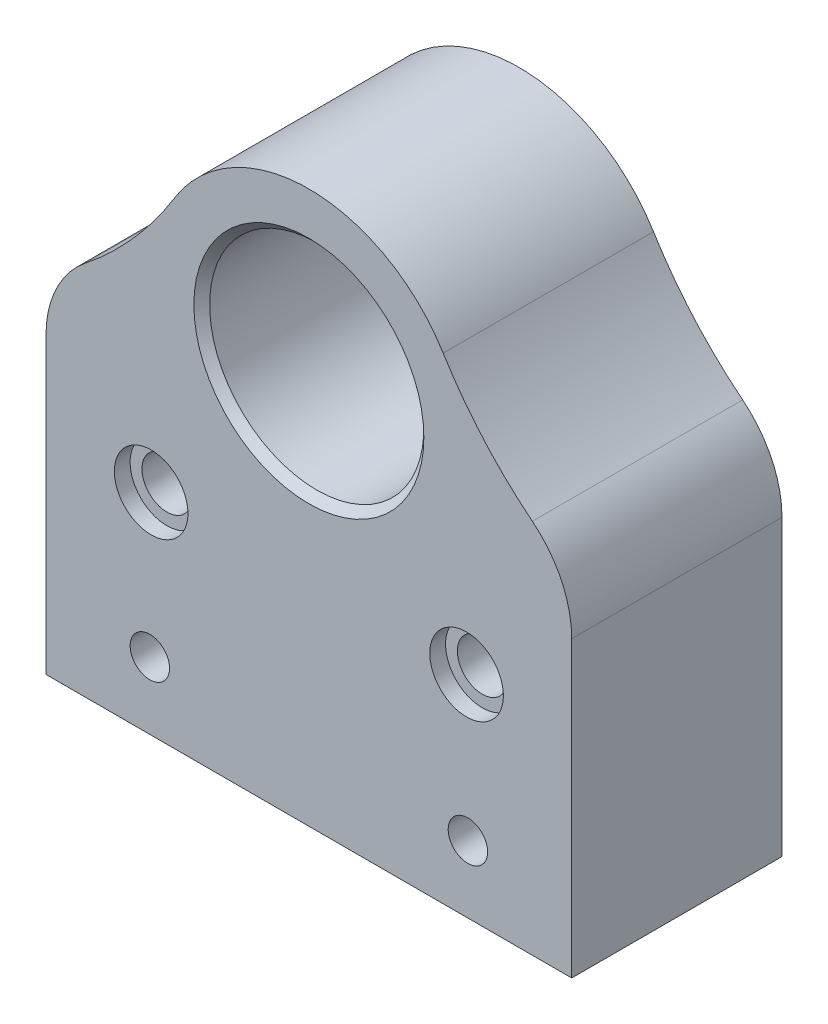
ISO-10303-21;
HEADER;
FILE_DESCRIPTION(('STEP AP214'),'2;1');
FILE_NAME('part.step','',(''),(''),'','','');
FILE_SCHEMA(('AUTOMOTIVE_DESIGN { 1 0 10303 214 1 1 1 1 }'));
ENDSEC;
DATA;
#1=APPLICATION_CONTEXT('core data for automotive mechanical design processes');
#2=APPLICATION_PROTOCOL_DEFINITION('international standard','automotive_design',2000,#1);
#3=PRODUCT_CONTEXT('',#1,'mechanical');
#4=PRODUCT('Part','Part','',(#3));
#5=PRODUCT_RELATED_PRODUCT_CATEGORY('part','',(#4));
#6=PRODUCT_DEFINITION_FORMATION('','',#4);
#7=PRODUCT_DEFINITION_CONTEXT('part definition',#1,'design');
#8=PRODUCT_DEFINITION('design','',#6,#7);
#9=PRODUCT_DEFINITION_SHAPE('','',#8);
#10=(LENGTH_UNIT() NAMED_UNIT(*) SI_UNIT(.MILLI.,.METRE.));
#11=(NAMED_UNIT(*) PLANE_ANGLE_UNIT() SI_UNIT($,.RADIAN.));
#12=(NAMED_UNIT(*) SI_UNIT($,.STERADIAN.) SOLID_ANGLE_UNIT());
#13=UNCERTAINTY_MEASURE_WITH_UNIT(LENGTH_MEASURE(1.E-05),#10,'distance_accuracy_value','');
#14=(GEOMETRIC_REPRESENTATION_CONTEXT(3) GLOBAL_UNCERTAINTY_ASSIGNED_CONTEXT((#13)) GLOBAL_UNIT_ASSIGNED_CONTEXT((#10,
#11,#12)) REPRESENTATION_CONTEXT('',''));
#15=CARTESIAN_POINT('',(0.,0.,0.));
#16=DIRECTION('',(0.,0.,1.));
#17=DIRECTION('',(1.,0.,0.));
#18=AXIS2_PLACEMENT_3D('',#15,#16,#17);
#19=CARTESIAN_POINT('',(0.,0.,4.8));
#20=DIRECTION('',(0.,0.,-1.));
#21=DIRECTION('',(0.,1.,0.));
#22=AXIS2_PLACEMENT_3D('',#19,#20,#21);
#23=CONICAL_SURFACE('',#22,4.075,0.785398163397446);
#24=CARTESIAN_POINT('',(0.,0.,4.8));
#25=DIRECTION('',(0.,0.,-1.));
#26=DIRECTION('',(0.,1.,0.));
#27=AXIS2_PLACEMENT_3D('',#24,#25,#26);
#28=CIRCLE('',#27,4.075);
#29=CARTESIAN_POINT('',(0.,4.075,4.8));
#30=VERTEX_POINT('',#29);
#31=EDGE_CURVE('E226',#30,#30,#28,.T.);
#32=ORIENTED_EDGE('',*,*,#31,.F.);
#33=EDGE_LOOP('',(#32));
#34=FACE_BOUND('',#33,.T.);
#35=CARTESIAN_POINT('',(0.,0.,4.5));
#36=DIRECTION('',(0.,0.,1.));
#37=DIRECTION('',(0.,1.,0.));
#38=AXIS2_PLACEMENT_3D('',#35,#36,#37);
#39=CIRCLE('',#38,4.375);
#40=CARTESIAN_POINT('',(0.,4.375,4.5));
#41=VERTEX_POINT('',#40);
#42=EDGE_CURVE('E184',#41,#41,#39,.T.);
#43=ORIENTED_EDGE('',*,*,#42,.F.);
#44=EDGE_LOOP('',(#43));
#45=FACE_BOUND('',#44,.T.);
#46=ADVANCED_FACE('F16',(#34,#45),#23,.F.);
#47=CARTESIAN_POINT('',(0.,0.,12.2));
#48=DIRECTION('',(0.,0.,1.));
#49=DIRECTION('',(0.,-1.,0.));
#50=AXIS2_PLACEMENT_3D('',#47,#48,#49);
#51=CONICAL_SURFACE('',#50,4.075,0.785398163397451);
#52=CARTESIAN_POINT('',(0.,0.,12.2));
#53=DIRECTION('',(0.,0.,1.));
#54=DIRECTION('',(0.,-1.,0.));
#55=AXIS2_PLACEMENT_3D('',#52,#53,#54);
#56=CIRCLE('',#55,4.075);
#57=CARTESIAN_POINT('',(0.,-4.075,12.2));
#58=VERTEX_POINT('',#57);
#59=EDGE_CURVE('E245',#58,#58,#56,.T.);
#60=ORIENTED_EDGE('',*,*,#59,.F.);
#61=EDGE_LOOP('',(#60));
#62=FACE_BOUND('',#61,.T.);
#63=CARTESIAN_POINT('',(0.,0.,12.5));
#64=DIRECTION('',(0.,0.,-1.));
#65=DIRECTION('',(0.,-1.,0.));
#66=AXIS2_PLACEMENT_3D('',#63,#64,#65);
#67=CIRCLE('',#66,4.375);
#68=CARTESIAN_POINT('',(0.,-4.375,12.5));
#69=VERTEX_POINT('',#68);
#70=EDGE_CURVE('E250',#69,#69,#67,.T.);
#71=ORIENTED_EDGE('',*,*,#70,.F.);
#72=EDGE_LOOP('',(#71));
#73=FACE_BOUND('',#72,.T.);
#74=ADVANCED_FACE('F373',(#62,#73),#51,.F.);
#75=CARTESIAN_POINT('',(-6.,-3.82101635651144,8.5));
#76=DIRECTION('',(0.,0.,1.));
#77=DIRECTION('',(0.,-1.,0.));
#78=AXIS2_PLACEMENT_3D('',#75,#76,#77);
#79=CYLINDRICAL_SURFACE('',#78,4.);
#80=CARTESIAN_POINT('',(-6.,-3.82101635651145,12.5));
#81=DIRECTION('',(0.,0.,1.));
#82=DIRECTION('',(0.,-1.,0.));
#83=AXIS2_PLACEMENT_3D('',#80,#81,#82);
#84=CIRCLE('',#83,4.);
#85=CARTESIAN_POINT('',(-8.50285133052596,-0.700802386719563,12.5));
#86=VERTEX_POINT('',#85);
#87=CARTESIAN_POINT('',(-10.,-3.82101635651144,12.5));
#88=VERTEX_POINT('',#87);
#89=EDGE_CURVE('E285',#86,#88,#84,.T.);
#90=ORIENTED_EDGE('',*,*,#89,.F.);
#91=DIRECTION('',(0.,0.,1.));
#92=VECTOR('',#91,1.);
#93=CARTESIAN_POINT('',(-8.50285133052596,-0.700802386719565,8.5));
#94=LINE('',#93,#92);
#95=CARTESIAN_POINT('',(-8.50285133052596,-0.700802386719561,4.5));
#96=VERTEX_POINT('',#95);
#97=EDGE_CURVE('E11',#96,#86,#94,.T.);
#98=ORIENTED_EDGE('',*,*,#97,.F.);
#99=CARTESIAN_POINT('',(-6.,-3.82101635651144,4.5));
#100=DIRECTION('',(0.,0.,-1.));
#101=DIRECTION('',(0.,1.,0.));
#102=AXIS2_PLACEMENT_3D('',#99,#100,#101);
#103=CIRCLE('',#102,4.);
#104=CARTESIAN_POINT('',(-10.,-3.82101635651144,4.5));
#105=VERTEX_POINT('',#104);
#106=EDGE_CURVE('E201',#105,#96,#103,.T.);
#107=ORIENTED_EDGE('',*,*,#106,.F.);
#108=DIRECTION('',(0.,0.,-1.));
#109=VECTOR('',#108,1.);
#110=CARTESIAN_POINT('',(-10.,-3.82101635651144,8.5));
#111=LINE('',#110,#109);
#112=EDGE_CURVE('E246',#88,#105,#111,.T.);
#113=ORIENTED_EDGE('',*,*,#112,.F.);
#114=EDGE_LOOP('',(#90,#98,#107,#113));
#115=FACE_BOUND('',#114,.T.);
#116=ADVANCED_FACE('F359',(#115),#79,.T.);
#117=CARTESIAN_POINT('',(6.,-3.82101635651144,8.5));
#118=DIRECTION('',(0.,0.,1.));
#119=DIRECTION('',(0.,-1.,0.));
#120=AXIS2_PLACEMENT_3D('',#117,#118,#119);
#121=CYLINDRICAL_SURFACE('',#120,4.);
#122=CARTESIAN_POINT('',(6.,-3.82101635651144,4.5));
#123=DIRECTION('',(0.,0.,-1.));
#124=DIRECTION('',(0.,1.,0.));
#125=AXIS2_PLACEMENT_3D('',#122,#123,#124);
#126=CIRCLE('',#125,4.);
#127=CARTESIAN_POINT('',(8.50285133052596,-0.700802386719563,4.5));
#128=VERTEX_POINT('',#127);
#129=CARTESIAN_POINT('',(10.,-3.82101635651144,4.5));
#130=VERTEX_POINT('',#129);
#131=EDGE_CURVE('E218',#128,#130,#126,.T.);
#132=ORIENTED_EDGE('',*,*,#131,.F.);
#133=DIRECTION('',(0.,0.,-1.));
#134=VECTOR('',#133,1.);
#135=CARTESIAN_POINT('',(8.50285133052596,-0.700802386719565,8.5));
#136=LINE('',#135,#134);
#137=CARTESIAN_POINT('',(8.50285133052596,-0.700802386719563,12.5));
#138=VERTEX_POINT('',#137);
#139=EDGE_CURVE('E24',#138,#128,#136,.T.);
#140=ORIENTED_EDGE('',*,*,#139,.F.);
#141=CARTESIAN_POINT('',(6.,-3.82101635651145,12.5));
#142=DIRECTION('',(0.,0.,1.));
#143=DIRECTION('',(0.,-1.,0.));
#144=AXIS2_PLACEMENT_3D('',#141,#142,#143);
#145=CIRCLE('',#144,4.);
#146=CARTESIAN_POINT('',(10.,-3.82101635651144,12.5));
#147=VERTEX_POINT('',#146);
#148=EDGE_CURVE('E269',#147,#138,#145,.T.);
#149=ORIENTED_EDGE('',*,*,#148,.F.);
#150=DIRECTION('',(0.,0.,1.));
#151=VECTOR('',#150,1.);
#152=CARTESIAN_POINT('',(10.,-3.82101635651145,12.5));
#153=LINE('',#152,#151);
#154=EDGE_CURVE('E242',#130,#147,#153,.T.);
#155=ORIENTED_EDGE('',*,*,#154,.F.);
#156=EDGE_LOOP('',(#132,#140,#149,#155));
#157=FACE_BOUND('',#156,.T.);
#158=ADVANCED_FACE('F331',(#157),#121,.T.);
#159=CARTESIAN_POINT('',(-17.8885438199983,11.,8.5));
#160=DIRECTION('',(0.,0.,1.));
#161=DIRECTION('',(0.,-1.,0.));
#162=AXIS2_PLACEMENT_3D('',#159,#160,#161);
#163=CYLINDRICAL_SURFACE('',#162,15.);
#164=CARTESIAN_POINT('',(-17.8885438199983,11.,4.5));
#165=DIRECTION('',(0.,0.,1.));
#166=DIRECTION('',(0.,1.,0.));
#167=AXIS2_PLACEMENT_3D('',#164,#165,#166);
#168=CIRCLE('',#167,15.);
#169=CARTESIAN_POINT('',(-5.11101251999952,3.14285714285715,4.5));
#170=VERTEX_POINT('',#169);
#171=EDGE_CURVE('E205',#96,#170,#168,.T.);
#172=ORIENTED_EDGE('',*,*,#171,.F.);
#173=ORIENTED_EDGE('',*,*,#97,.T.);
#174=CARTESIAN_POINT('',(-17.8885438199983,11.,12.5));
#175=DIRECTION('',(0.,0.,-1.));
#176=DIRECTION('',(0.,-1.,0.));
#177=AXIS2_PLACEMENT_3D('',#174,#175,#176);
#178=CIRCLE('',#177,15.);
#179=CARTESIAN_POINT('',(-5.11101251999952,3.14285714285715,12.5));
#180=VERTEX_POINT('',#179);
#181=EDGE_CURVE('E281',#180,#86,#178,.T.);
#182=ORIENTED_EDGE('',*,*,#181,.F.);
#183=DIRECTION('',(0.,0.,1.));
#184=VECTOR('',#183,1.);
#185=CARTESIAN_POINT('',(-5.11101251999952,3.14285714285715,8.5));
#186=LINE('',#185,#184);
#187=EDGE_CURVE('E225',#170,#180,#186,.T.);
#188=ORIENTED_EDGE('',*,*,#187,.F.);
#189=EDGE_LOOP('',(#172,#173,#182,#188));
#190=FACE_BOUND('',#189,.T.);
#191=ADVANCED_FACE('F361',(#190),#163,.F.);
#192=CARTESIAN_POINT('',(17.8885438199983,11.,8.5));
#193=DIRECTION('',(0.,0.,1.));
#194=DIRECTION('',(0.,-1.,0.));
#195=AXIS2_PLACEMENT_3D('',#192,#193,#194);
#196=CYLINDRICAL_SURFACE('',#195,15.);
#197=CARTESIAN_POINT('',(17.8885438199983,11.,12.5));
#198=DIRECTION('',(0.,0.,-1.));
#199=DIRECTION('',(0.,-1.,0.));
#200=AXIS2_PLACEMENT_3D('',#197,#198,#199);
#201=CIRCLE('',#200,15.);
#202=CARTESIAN_POINT('',(5.11101251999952,3.14285714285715,12.5));
#203=VERTEX_POINT('',#202);
#204=EDGE_CURVE('E273',#138,#203,#201,.T.);
#205=ORIENTED_EDGE('',*,*,#204,.F.);
#206=ORIENTED_EDGE('',*,*,#139,.T.);
#207=CARTESIAN_POINT('',(17.8885438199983,11.,4.5));
#208=DIRECTION('',(0.,0.,1.));
#209=DIRECTION('',(0.,1.,0.));
#210=AXIS2_PLACEMENT_3D('',#207,#208,#209);
#211=CIRCLE('',#210,15.);
#212=CARTESIAN_POINT('',(5.11101251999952,3.14285714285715,4.5));
#213=VERTEX_POINT('',#212);
#214=EDGE_CURVE('E209',#213,#128,#211,.T.);
#215=ORIENTED_EDGE('',*,*,#214,.F.);
#216=DIRECTION('',(0.,0.,-1.));
#217=VECTOR('',#216,1.);
#218=CARTESIAN_POINT('',(5.11101251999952,3.14285714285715,8.5));
#219=LINE('',#218,#217);
#220=EDGE_CURVE('E222',#203,#213,#219,.T.);
#221=ORIENTED_EDGE('',*,*,#220,.F.);
#222=EDGE_LOOP('',(#205,#206,#215,#221));
#223=FACE_BOUND('',#222,.T.);
#224=ADVANCED_FACE('F328',(#223),#196,.F.);
#225=CARTESIAN_POINT('',(6.,-7.,12.5));
#226=DIRECTION('',(0.,0.,-1.));
#227=DIRECTION('',(0.,1.,0.));
#228=AXIS2_PLACEMENT_3D('',#225,#226,#227);
#229=CYLINDRICAL_SURFACE('',#228,1.4);
#230=CARTESIAN_POINT('',(6.,-7.,12.5));
#231=DIRECTION('',(0.,0.,-1.));
#232=DIRECTION('',(0.,1.,0.));
#233=AXIS2_PLACEMENT_3D('',#230,#231,#232);
#234=CIRCLE('',#233,1.4);
#235=CARTESIAN_POINT('',(6.,-5.6,12.5));
#236=VERTEX_POINT('',#235);
#237=EDGE_CURVE('E253',#236,#236,#234,.T.);
#238=ORIENTED_EDGE('',*,*,#237,.F.);
#239=EDGE_LOOP('',(#238));
#240=FACE_BOUND('',#239,.T.);
#241=CARTESIAN_POINT('',(6.,-7.,11.9));
#242=DIRECTION('',(0.,0.,-1.));
#243=DIRECTION('',(0.,1.,0.));
#244=AXIS2_PLACEMENT_3D('',#241,#242,#243);
#245=CIRCLE('',#244,1.4);
#246=CARTESIAN_POINT('',(6.,-5.6,11.9));
#247=VERTEX_POINT('',#246);
#248=EDGE_CURVE('E34',#247,#247,#245,.T.);
#249=ORIENTED_EDGE('',*,*,#248,.T.);
#250=EDGE_LOOP('',(#249));
#251=FACE_BOUND('',#250,.T.);
#252=ADVANCED_FACE('F369',(#240,#251),#229,.F.);
#253=CARTESIAN_POINT('',(7.4,-7.,11.9));
#254=DIRECTION('',(0.,0.,1.));
#255=DIRECTION('',(0.,-1.,0.));
#256=AXIS2_PLACEMENT_3D('',#253,#254,#255);
#257=PLANE('',#256);
#258=ORIENTED_EDGE('',*,*,#248,.F.);
#259=EDGE_LOOP('',(#258));
#260=FACE_BOUND('',#259,.T.);
#261=CARTESIAN_POINT('',(6.,-7.,11.9));
#262=DIRECTION('',(0.,0.,-1.));
#263=DIRECTION('',(0.,1.,0.));
#264=AXIS2_PLACEMENT_3D('',#261,#262,#263);
#265=CIRCLE('',#264,0.95);
#266=CARTESIAN_POINT('',(6.,-6.05,11.9));
#267=VERTEX_POINT('',#266);
#268=EDGE_CURVE('E41',#267,#267,#265,.T.);
#269=ORIENTED_EDGE('',*,*,#268,.T.);
#270=EDGE_LOOP('',(#269));
#271=FACE_BOUND('',#270,.T.);
#272=ADVANCED_FACE('F411',(#260,#271),#257,.T.);
#273=CARTESIAN_POINT('',(6.,-7.,12.5));
#274=DIRECTION('',(0.,0.,-1.));
#275=DIRECTION('',(0.,1.,0.));
#276=AXIS2_PLACEMENT_3D('',#273,#274,#275);
#277=CYLINDRICAL_SURFACE('',#276,0.95);
#278=ORIENTED_EDGE('',*,*,#268,.F.);
#279=EDGE_LOOP('',(#278));
#280=FACE_BOUND('',#279,.T.);
#281=CARTESIAN_POINT('',(6.,-7.,4.5));
#282=DIRECTION('',(0.,0.,-1.));
#283=DIRECTION('',(0.,1.,0.));
#284=AXIS2_PLACEMENT_3D('',#281,#282,#283);
#285=CIRCLE('',#284,0.95);
#286=CARTESIAN_POINT('',(6.,-6.05,4.5));
#287=VERTEX_POINT('',#286);
#288=EDGE_CURVE('E179',#287,#287,#285,.T.);
#289=ORIENTED_EDGE('',*,*,#288,.T.);
#290=EDGE_LOOP('',(#289));
#291=FACE_BOUND('',#290,.T.);
#292=ADVANCED_FACE('F180',(#280,#291),#277,.F.);
#293=CARTESIAN_POINT('',(-6.,-7.,12.5));
#294=DIRECTION('',(0.,0.,-1.));
#295=DIRECTION('',(0.,1.,0.));
#296=AXIS2_PLACEMENT_3D('',#293,#294,#295);
#297=CYLINDRICAL_SURFACE('',#296,1.4);
#298=CARTESIAN_POINT('',(-6.,-7.,12.5));
#299=DIRECTION('',(0.,0.,-1.));
#300=DIRECTION('',(0.,1.,0.));
#301=AXIS2_PLACEMENT_3D('',#298,#299,#300);
#302=CIRCLE('',#301,1.4);
#303=CARTESIAN_POINT('',(-6.,-5.6,12.5));
#304=VERTEX_POINT('',#303);
#305=EDGE_CURVE('E237',#304,#304,#302,.T.);
#306=ORIENTED_EDGE('',*,*,#305,.F.);
#307=EDGE_LOOP('',(#306));
#308=FACE_BOUND('',#307,.T.);
#309=CARTESIAN_POINT('',(-6.,-7.,11.9));
#310=DIRECTION('',(0.,0.,-1.));
#311=DIRECTION('',(0.,1.,0.));
#312=AXIS2_PLACEMENT_3D('',#309,#310,#311);
#313=CIRCLE('',#312,1.4);
#314=CARTESIAN_POINT('',(-6.,-5.6,11.9));
#315=VERTEX_POINT('',#314);
#316=EDGE_CURVE('E318',#315,#315,#313,.T.);
#317=ORIENTED_EDGE('',*,*,#316,.T.);
#318=EDGE_LOOP('',(#317));
#319=FACE_BOUND('',#318,.T.);
#320=ADVANCED_FACE('F410',(#308,#319),#297,.F.);
#321=CARTESIAN_POINT('',(-4.6,-7.,11.9));
#322=DIRECTION('',(0.,0.,1.));
#323=DIRECTION('',(0.,-1.,0.));
#324=AXIS2_PLACEMENT_3D('',#321,#322,#323);
#325=PLANE('',#324);
#326=ORIENTED_EDGE('',*,*,#316,.F.);
#327=EDGE_LOOP('',(#326));
#328=FACE_BOUND('',#327,.T.);
#329=CARTESIAN_POINT('',(-6.,-7.,11.9));
#330=DIRECTION('',(0.,0.,-1.));
#331=DIRECTION('',(0.,1.,0.));
#332=AXIS2_PLACEMENT_3D('',#329,#330,#331);
#333=CIRCLE('',#332,0.95);
#334=CARTESIAN_POINT('',(-6.,-6.05,11.9));
#335=VERTEX_POINT('',#334);
#336=EDGE_CURVE('E315',#335,#335,#333,.T.);
#337=ORIENTED_EDGE('',*,*,#336,.T.);
#338=EDGE_LOOP('',(#337));
#339=FACE_BOUND('',#338,.T.);
#340=ADVANCED_FACE('F428',(#328,#339),#325,.T.);
#341=CARTESIAN_POINT('',(-6.,-7.,12.5));
#342=DIRECTION('',(0.,0.,-1.));
#343=DIRECTION('',(0.,1.,0.));
#344=AXIS2_PLACEMENT_3D('',#341,#342,#343);
#345=CYLINDRICAL_SURFACE('',#344,0.95);
#346=ORIENTED_EDGE('',*,*,#336,.F.);
#347=EDGE_LOOP('',(#346));
#348=FACE_BOUND('',#347,.T.);
#349=CARTESIAN_POINT('',(-6.,-7.,4.5));
#350=DIRECTION('',(0.,0.,-1.));
#351=DIRECTION('',(0.,1.,0.));
#352=AXIS2_PLACEMENT_3D('',#349,#350,#351);
#353=CIRCLE('',#352,0.95);
#354=CARTESIAN_POINT('',(-6.,-6.05,4.5));
#355=VERTEX_POINT('',#354);
#356=EDGE_CURVE('E183',#355,#355,#353,.T.);
#357=ORIENTED_EDGE('',*,*,#356,.T.);
#358=EDGE_LOOP('',(#357));
#359=FACE_BOUND('',#358,.T.);
#360=ADVANCED_FACE('F431',(#348,#359),#345,.F.);
#361=CARTESIAN_POINT('',(-6.05,-12.45,4.5));
#362=DIRECTION('',(0.,0.,1.));
#363=DIRECTION('',(0.,-1.,0.));
#364=AXIS2_PLACEMENT_3D('',#361,#362,#363);
#365=CYLINDRICAL_SURFACE('',#364,1.1);
#366=CARTESIAN_POINT('',(-6.05,-12.45,4.5));
#367=DIRECTION('',(0.,0.,1.));
#368=DIRECTION('',(0.,-1.,0.));
#369=AXIS2_PLACEMENT_3D('',#366,#367,#368);
#370=CIRCLE('',#369,1.1);
#371=CARTESIAN_POINT('',(-6.05,-13.55,4.5));
#372=VERTEX_POINT('',#371);
#373=EDGE_CURVE('E189',#372,#372,#370,.T.);
#374=ORIENTED_EDGE('',*,*,#373,.F.);
#375=EDGE_LOOP('',(#374));
#376=FACE_BOUND('',#375,.T.);
#377=CARTESIAN_POINT('',(-6.05,-12.45,5.1));
#378=DIRECTION('',(0.,0.,1.));
#379=DIRECTION('',(0.,-1.,0.));
#380=AXIS2_PLACEMENT_3D('',#377,#378,#379);
#381=CIRCLE('',#380,1.1);
#382=CARTESIAN_POINT('',(-6.05,-13.55,5.1));
#383=VERTEX_POINT('',#382);
#384=EDGE_CURVE('E312',#383,#383,#381,.T.);
#385=ORIENTED_EDGE('',*,*,#384,.T.);
#386=EDGE_LOOP('',(#385));
#387=FACE_BOUND('',#386,.T.);
#388=ADVANCED_FACE('F426',(#376,#387),#365,.F.);
#389=CARTESIAN_POINT('',(-4.95,-12.45,5.1));
#390=DIRECTION('',(0.,0.,-1.));
#391=DIRECTION('',(-1.,0.,0.));
#392=AXIS2_PLACEMENT_3D('',#389,#390,#391);
#393=PLANE('',#392);
#394=ORIENTED_EDGE('',*,*,#384,.F.);
#395=EDGE_LOOP('',(#394));
#396=FACE_BOUND('',#395,.T.);
#397=CARTESIAN_POINT('',(-6.05,-12.45,5.1));
#398=DIRECTION('',(0.,0.,1.));
#399=DIRECTION('',(0.,-1.,0.));
#400=AXIS2_PLACEMENT_3D('',#397,#398,#399);
#401=CIRCLE('',#400,0.75);
#402=CARTESIAN_POINT('',(-6.05,-13.2,5.1));
#403=VERTEX_POINT('',#402);
#404=EDGE_CURVE('E307',#403,#403,#401,.T.);
#405=ORIENTED_EDGE('',*,*,#404,.T.);
#406=EDGE_LOOP('',(#405));
#407=FACE_BOUND('',#406,.T.);
#408=ADVANCED_FACE('F422',(#396,#407),#393,.T.);
#409=CARTESIAN_POINT('',(-6.05,-12.45,4.5));
#410=DIRECTION('',(0.,0.,1.));
#411=DIRECTION('',(0.,-1.,0.));
#412=AXIS2_PLACEMENT_3D('',#409,#410,#411);
#413=CYLINDRICAL_SURFACE('',#412,0.75);
#414=ORIENTED_EDGE('',*,*,#404,.F.);
#415=EDGE_LOOP('',(#414));
#416=FACE_BOUND('',#415,.T.);
#417=CARTESIAN_POINT('',(-6.05,-12.45,12.5));
#418=DIRECTION('',(0.,0.,1.));
#419=DIRECTION('',(0.,-1.,0.));
#420=AXIS2_PLACEMENT_3D('',#417,#418,#419);
#421=CIRCLE('',#420,0.75);
#422=CARTESIAN_POINT('',(-6.05,-13.2,12.5));
#423=VERTEX_POINT('',#422);
#424=EDGE_CURVE('E233',#423,#423,#421,.T.);
#425=ORIENTED_EDGE('',*,*,#424,.T.);
#426=EDGE_LOOP('',(#425));
#427=FACE_BOUND('',#426,.T.);
#428=ADVANCED_FACE('F418',(#416,#427),#413,.F.);
#429=CARTESIAN_POINT('',(6.05,-12.45,4.5));
#430=DIRECTION('',(0.,0.,1.));
#431=DIRECTION('',(0.,-1.,0.));
#432=AXIS2_PLACEMENT_3D('',#429,#430,#431);
#433=CYLINDRICAL_SURFACE('',#432,1.1);
#434=CARTESIAN_POINT('',(6.05,-12.45,4.5));
#435=DIRECTION('',(0.,0.,1.));
#436=DIRECTION('',(0.,-1.,0.));
#437=AXIS2_PLACEMENT_3D('',#434,#435,#436);
#438=CIRCLE('',#437,1.1);
#439=CARTESIAN_POINT('',(6.05,-13.55,4.5));
#440=VERTEX_POINT('',#439);
#441=EDGE_CURVE('E206',#440,#440,#438,.T.);
#442=ORIENTED_EDGE('',*,*,#441,.F.);
#443=EDGE_LOOP('',(#442));
#444=FACE_BOUND('',#443,.T.);
#445=CARTESIAN_POINT('',(6.05,-12.45,5.1));
#446=DIRECTION('',(0.,0.,1.));
#447=DIRECTION('',(0.,-1.,0.));
#448=AXIS2_PLACEMENT_3D('',#445,#446,#447);
#449=CIRCLE('',#448,1.1);
#450=CARTESIAN_POINT('',(6.05,-13.55,5.1));
#451=VERTEX_POINT('',#450);
#452=EDGE_CURVE('E304',#451,#451,#449,.T.);
#453=ORIENTED_EDGE('',*,*,#452,.T.);
#454=EDGE_LOOP('',(#453));
#455=FACE_BOUND('',#454,.T.);
#456=ADVANCED_FACE('F403',(#444,#455),#433,.F.);
#457=CARTESIAN_POINT('',(7.15,-12.45,5.1));
#458=DIRECTION('',(0.,0.,-1.));
#459=DIRECTION('',(-1.,0.,0.));
#460=AXIS2_PLACEMENT_3D('',#457,#458,#459);
#461=PLANE('',#460);
#462=ORIENTED_EDGE('',*,*,#452,.F.);
#463=EDGE_LOOP('',(#462));
#464=FACE_BOUND('',#463,.T.);
#465=CARTESIAN_POINT('',(6.05,-12.45,5.1));
#466=DIRECTION('',(0.,0.,1.));
#467=DIRECTION('',(0.,-1.,0.));
#468=AXIS2_PLACEMENT_3D('',#465,#466,#467);
#469=CIRCLE('',#468,0.75);
#470=CARTESIAN_POINT('',(6.05,-13.2,5.1));
#471=VERTEX_POINT('',#470);
#472=EDGE_CURVE('E260',#471,#471,#469,.T.);
#473=ORIENTED_EDGE('',*,*,#472,.T.);
#474=EDGE_LOOP('',(#473));
#475=FACE_BOUND('',#474,.T.);
#476=ADVANCED_FACE('F400',(#464,#475),#461,.T.);
#477=CARTESIAN_POINT('',(6.05,-12.45,4.5));
#478=DIRECTION('',(0.,0.,1.));
#479=DIRECTION('',(0.,-1.,0.));
#480=AXIS2_PLACEMENT_3D('',#477,#478,#479);
#481=CYLINDRICAL_SURFACE('',#480,0.75);
#482=ORIENTED_EDGE('',*,*,#472,.F.);
#483=EDGE_LOOP('',(#482));
#484=FACE_BOUND('',#483,.T.);
#485=CARTESIAN_POINT('',(6.05,-12.45,12.5));
#486=DIRECTION('',(0.,0.,1.));
#487=DIRECTION('',(0.,-1.,0.));
#488=AXIS2_PLACEMENT_3D('',#485,#486,#487);
#489=CIRCLE('',#488,0.75);
#490=CARTESIAN_POINT('',(6.05,-13.2,12.5));
#491=VERTEX_POINT('',#490);
#492=EDGE_CURVE('E236',#491,#491,#489,.T.);
#493=ORIENTED_EDGE('',*,*,#492,.T.);
#494=EDGE_LOOP('',(#493));
#495=FACE_BOUND('',#494,.T.);
#496=ADVANCED_FACE('F393',(#484,#495),#481,.F.);
#497=CARTESIAN_POINT('',(0.,0.,8.5));
#498=DIRECTION('',(0.,0.,1.));
#499=DIRECTION('',(0.,-1.,0.));
#500=AXIS2_PLACEMENT_3D('',#497,#498,#499);
#501=CYLINDRICAL_SURFACE('',#500,6.);
#502=CARTESIAN_POINT('',(0.,0.,12.5));
#503=DIRECTION('',(0.,0.,1.));
#504=DIRECTION('',(0.,-1.,0.));
#505=AXIS2_PLACEMENT_3D('',#502,#503,#504);
#506=CIRCLE('',#505,6.);
#507=EDGE_CURVE('E277',#203,#180,#506,.T.);
#508=ORIENTED_EDGE('',*,*,#507,.F.);
#509=ORIENTED_EDGE('',*,*,#220,.T.);
#510=CARTESIAN_POINT('',(0.,0.,4.5));
#511=DIRECTION('',(0.,0.,-1.));
#512=DIRECTION('',(0.,1.,0.));
#513=AXIS2_PLACEMENT_3D('',#510,#511,#512);
#514=CIRCLE('',#513,6.);
#515=EDGE_CURVE('E241',#170,#213,#514,.T.);
#516=ORIENTED_EDGE('',*,*,#515,.F.);
#517=ORIENTED_EDGE('',*,*,#187,.T.);
#518=EDGE_LOOP('',(#508,#509,#516,#517));
#519=FACE_BOUND('',#518,.T.);
#520=ADVANCED_FACE('F340',(#519),#501,.T.);
#521=CARTESIAN_POINT('',(0.,0.,-12.5));
#522=DIRECTION('',(0.,0.,1.));
#523=DIRECTION('',(0.,-1.,0.));
#524=AXIS2_PLACEMENT_3D('',#521,#522,#523);
#525=CYLINDRICAL_SURFACE('',#524,4.075);
#526=ORIENTED_EDGE('',*,*,#31,.T.);
#527=EDGE_LOOP('',(#526));
#528=FACE_BOUND('',#527,.T.);
#529=ORIENTED_EDGE('',*,*,#59,.T.);
#530=EDGE_LOOP('',(#529));
#531=FACE_BOUND('',#530,.T.);
#532=ADVANCED_FACE('F392',(#528,#531),#525,.F.);
#533=CARTESIAN_POINT('',(10.,-20.675,8.5));
#534=DIRECTION('',(1.,0.,0.));
#535=DIRECTION('',(0.,1.,0.));
#536=AXIS2_PLACEMENT_3D('',#533,#534,#535);
#537=PLANE('',#536);
#538=DIRECTION('',(0.,-1.,0.));
#539=VECTOR('',#538,1.);
#540=CARTESIAN_POINT('',(10.,-9.5,4.5));
#541=LINE('',#540,#539);
#542=CARTESIAN_POINT('',(10.,-15.,4.5));
#543=VERTEX_POINT('',#542);
#544=EDGE_CURVE('E200',#130,#543,#541,.T.);
#545=ORIENTED_EDGE('',*,*,#544,.F.);
#546=ORIENTED_EDGE('',*,*,#154,.T.);
#547=DIRECTION('',(0.,1.,0.));
#548=VECTOR('',#547,1.);
#549=CARTESIAN_POINT('',(10.,-9.5,12.5));
#550=LINE('',#549,#548);
#551=CARTESIAN_POINT('',(10.,-15.,12.5));
#552=VERTEX_POINT('',#551);
#553=EDGE_CURVE('E265',#552,#147,#550,.T.);
#554=ORIENTED_EDGE('',*,*,#553,.F.);
#555=DIRECTION('',(0.,0.,-1.));
#556=VECTOR('',#555,1.);
#557=CARTESIAN_POINT('',(10.,-15.,8.5));
#558=LINE('',#557,#556);
#559=EDGE_CURVE('E213',#552,#543,#558,.T.);
#560=ORIENTED_EDGE('',*,*,#559,.T.);
#561=EDGE_LOOP('',(#545,#546,#554,#560));
#562=FACE_BOUND('',#561,.T.);
#563=ADVANCED_FACE('F349',(#562),#537,.T.);
#564=CARTESIAN_POINT('',(-10.,-20.675,8.5));
#565=DIRECTION('',(1.,0.,0.));
#566=DIRECTION('',(0.,1.,0.));
#567=AXIS2_PLACEMENT_3D('',#564,#565,#566);
#568=PLANE('',#567);
#569=DIRECTION('',(0.,1.,0.));
#570=VECTOR('',#569,1.);
#571=CARTESIAN_POINT('',(-10.,-9.5,12.5));
#572=LINE('',#571,#570);
#573=CARTESIAN_POINT('',(-10.,-15.,12.5));
#574=VERTEX_POINT('',#573);
#575=EDGE_CURVE('E289',#574,#88,#572,.T.);
#576=ORIENTED_EDGE('',*,*,#575,.T.);
#577=ORIENTED_EDGE('',*,*,#112,.T.);
#578=DIRECTION('',(0.,-1.,0.));
#579=VECTOR('',#578,1.);
#580=CARTESIAN_POINT('',(-10.,-9.5,4.5));
#581=LINE('',#580,#579);
#582=CARTESIAN_POINT('',(-10.,-15.,4.5));
#583=VERTEX_POINT('',#582);
#584=EDGE_CURVE('E199',#105,#583,#581,.T.);
#585=ORIENTED_EDGE('',*,*,#584,.T.);
#586=DIRECTION('',(0.,0.,-1.));
#587=VECTOR('',#586,1.);
#588=CARTESIAN_POINT('',(-10.,-15.,8.5));
#589=LINE('',#588,#587);
#590=EDGE_CURVE('E210',#574,#583,#589,.T.);
#591=ORIENTED_EDGE('',*,*,#590,.F.);
#592=EDGE_LOOP('',(#576,#577,#585,#591));
#593=FACE_BOUND('',#592,.T.);
#594=ADVANCED_FACE('F355',(#593),#568,.F.);
#595=CARTESIAN_POINT('',(6.,-15.,8.5));
#596=DIRECTION('',(0.,1.,0.));
#597=DIRECTION('',(0.,0.,-1.));
#598=AXIS2_PLACEMENT_3D('',#595,#596,#597);
#599=PLANE('',#598);
#600=DIRECTION('',(-1.,0.,0.));
#601=VECTOR('',#600,1.);
#602=CARTESIAN_POINT('',(6.,-15.,12.5));
#603=LINE('',#602,#601);
#604=EDGE_CURVE('E214',#552,#574,#603,.T.);
#605=ORIENTED_EDGE('',*,*,#604,.T.);
#606=ORIENTED_EDGE('',*,*,#590,.T.);
#607=DIRECTION('',(-1.,0.,0.));
#608=VECTOR('',#607,1.);
#609=CARTESIAN_POINT('',(6.,-15.,4.5));
#610=LINE('',#609,#608);
#611=EDGE_CURVE('E195',#543,#583,#610,.T.);
#612=ORIENTED_EDGE('',*,*,#611,.F.);
#613=ORIENTED_EDGE('',*,*,#559,.F.);
#614=EDGE_LOOP('',(#605,#606,#612,#613));
#615=FACE_BOUND('',#614,.T.);
#616=ADVANCED_FACE('F353',(#615),#599,.F.);
#617=CARTESIAN_POINT('',(6.,1.,12.5));
#618=DIRECTION('',(0.,0.,1.));
#619=DIRECTION('',(0.,-1.,0.));
#620=AXIS2_PLACEMENT_3D('',#617,#618,#619);
#621=PLANE('',#620);
#622=ORIENTED_EDGE('',*,*,#553,.T.);
#623=ORIENTED_EDGE('',*,*,#148,.T.);
#624=ORIENTED_EDGE('',*,*,#204,.T.);
#625=ORIENTED_EDGE('',*,*,#507,.T.);
#626=ORIENTED_EDGE('',*,*,#181,.T.);
#627=ORIENTED_EDGE('',*,*,#89,.T.);
#628=ORIENTED_EDGE('',*,*,#575,.F.);
#629=ORIENTED_EDGE('',*,*,#604,.F.);
#630=EDGE_LOOP('',(#622,#623,#624,#625,#626,#627,#628,#629));
#631=FACE_BOUND('',#630,.T.);
#632=ORIENTED_EDGE('',*,*,#492,.F.);
#633=EDGE_LOOP('',(#632));
#634=FACE_BOUND('',#633,.T.);
#635=ORIENTED_EDGE('',*,*,#424,.F.);
#636=EDGE_LOOP('',(#635));
#637=FACE_BOUND('',#636,.T.);
#638=ORIENTED_EDGE('',*,*,#305,.T.);
#639=EDGE_LOOP('',(#638));
#640=FACE_BOUND('',#639,.T.);
#641=ORIENTED_EDGE('',*,*,#237,.T.);
#642=EDGE_LOOP('',(#641));
#643=FACE_BOUND('',#642,.T.);
#644=ORIENTED_EDGE('',*,*,#70,.T.);
#645=EDGE_LOOP('',(#644));
#646=FACE_BOUND('',#645,.T.);
#647=ADVANCED_FACE('F343',(#631,#634,#637,#640,#643,#646),#621,.T.);
#648=CARTESIAN_POINT('',(6.,1.,4.5));
#649=DIRECTION('',(0.,0.,-1.));
#650=DIRECTION('',(-1.,0.,0.));
#651=AXIS2_PLACEMENT_3D('',#648,#649,#650);
#652=PLANE('',#651);
#653=ORIENTED_EDGE('',*,*,#214,.T.);
#654=ORIENTED_EDGE('',*,*,#131,.T.);
#655=ORIENTED_EDGE('',*,*,#544,.T.);
#656=ORIENTED_EDGE('',*,*,#611,.T.);
#657=ORIENTED_EDGE('',*,*,#584,.F.);
#658=ORIENTED_EDGE('',*,*,#106,.T.);
#659=ORIENTED_EDGE('',*,*,#171,.T.);
#660=ORIENTED_EDGE('',*,*,#515,.T.);
#661=EDGE_LOOP('',(#653,#654,#655,#656,#657,#658,#659,#660));
#662=FACE_BOUND('',#661,.T.);
#663=ORIENTED_EDGE('',*,*,#441,.T.);
#664=EDGE_LOOP('',(#663));
#665=FACE_BOUND('',#664,.T.);
#666=ORIENTED_EDGE('',*,*,#373,.T.);
#667=EDGE_LOOP('',(#666));
#668=FACE_BOUND('',#667,.T.);
#669=ORIENTED_EDGE('',*,*,#356,.F.);
#670=EDGE_LOOP('',(#669));
#671=FACE_BOUND('',#670,.T.);
#672=ORIENTED_EDGE('',*,*,#288,.F.);
#673=EDGE_LOOP('',(#672));
#674=FACE_BOUND('',#673,.T.);
#675=ORIENTED_EDGE('',*,*,#42,.T.);
#676=EDGE_LOOP('',(#675));
#677=FACE_BOUND('',#676,.T.);
#678=ADVANCED_FACE('F334',(#662,#665,#668,#671,#674,#677),#652,.T.);
#679=CLOSED_SHELL('',(#46,#74,#116,#158,#191,#224,#252,#272,#292,#320,#340,#360,#388,#408,#428,
#456,#476,#496,#520,#532,#563,#594,#616,#647,#678));
#680=MANIFOLD_SOLID_BREP('B1',#679);
#681=ADVANCED_BREP_SHAPE_REPRESENTATION('',(#18,#680),#14);
#682=SHAPE_DEFINITION_REPRESENTATION(#9,#681);
ENDSEC;
END-ISO-10303-21;
